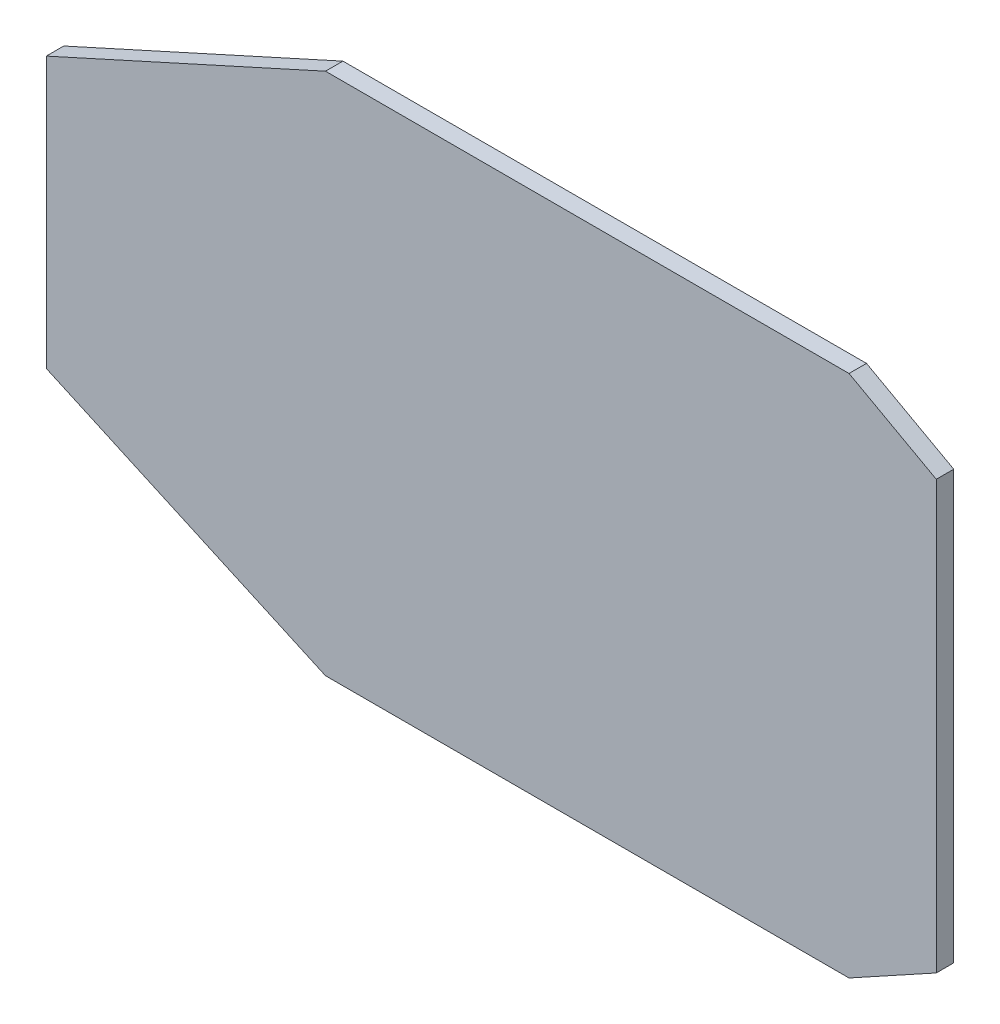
from build123d import *

# Parameters (mm, degrees)
ESQUISSE1_W      = 510
ESQUISSE1_H      = 300
EXTRUSION1_DEPTH = 10
CHANFREIN1_SIZE  = 27.5
CHANFREIN1_SIZE2 = 50
CHANFREIN2_SIZE  = 50
CHANFREIN2_SIZE2 = 27.5
CHANFREIN3_SIZE  = 160
CHANFREIN3_SIZE2 = 72.5
CHANFREIN4_SIZE  = 72.5
CHANFREIN4_SIZE2 = 160


with BuildPart() as part:
    # Esquisse1 → Extrusion1 (new body)
    with BuildSketch(Plane.XY):
        with Locations((255, 150)):
            Rectangle(ESQUISSE1_W, ESQUISSE1_H)
    extrude(amount=EXTRUSION1_DEPTH)

    # Chanfrein1
    chanfrein1_edges = [part.edges().sort_by_distance(p)[0] for p in [
        (510, 300, 5),
    ]]
    chanfrein1_side = [part.faces().sort_by_distance(p)[0] for p in [
        (510, 150, 5),
    ]]
    chamfer(chanfrein1_edges, length=CHANFREIN1_SIZE, length2=CHANFREIN1_SIZE2, reference=chanfrein1_side[0])

    # Chanfrein2
    chanfrein2_edges = [part.edges().sort_by_distance(p)[0] for p in [
        (510, 0, 5),
    ]]
    chanfrein2_side = [part.faces().sort_by_distance(p)[0] for p in [
        (255, 0, 5),
    ]]
    chamfer(chanfrein2_edges, length=CHANFREIN2_SIZE, length2=CHANFREIN2_SIZE2, reference=chanfrein2_side[0])

    # Chanfrein3
    chanfrein3_edges = [part.edges().sort_by_distance(p)[0] for p in [
        (0, 300, 5),
    ]]
    chanfrein3_side = [part.faces().sort_by_distance(p)[0] for p in [
        (230, 300, 5),
    ]]
    chamfer(chanfrein3_edges, length=CHANFREIN3_SIZE, length2=CHANFREIN3_SIZE2, reference=chanfrein3_side[0])

    # Chanfrein4
    chanfrein4_edges = [part.edges().sort_by_distance(p)[0] for p in [
        (0, 0, 5),
    ]]
    chanfrein4_side = [part.faces().sort_by_distance(p)[0] for p in [
        (0, 113.75, 5),
    ]]
    chamfer(chanfrein4_edges, length=CHANFREIN4_SIZE, length2=CHANFREIN4_SIZE2, reference=chanfrein4_side[0])


solid = part.part
